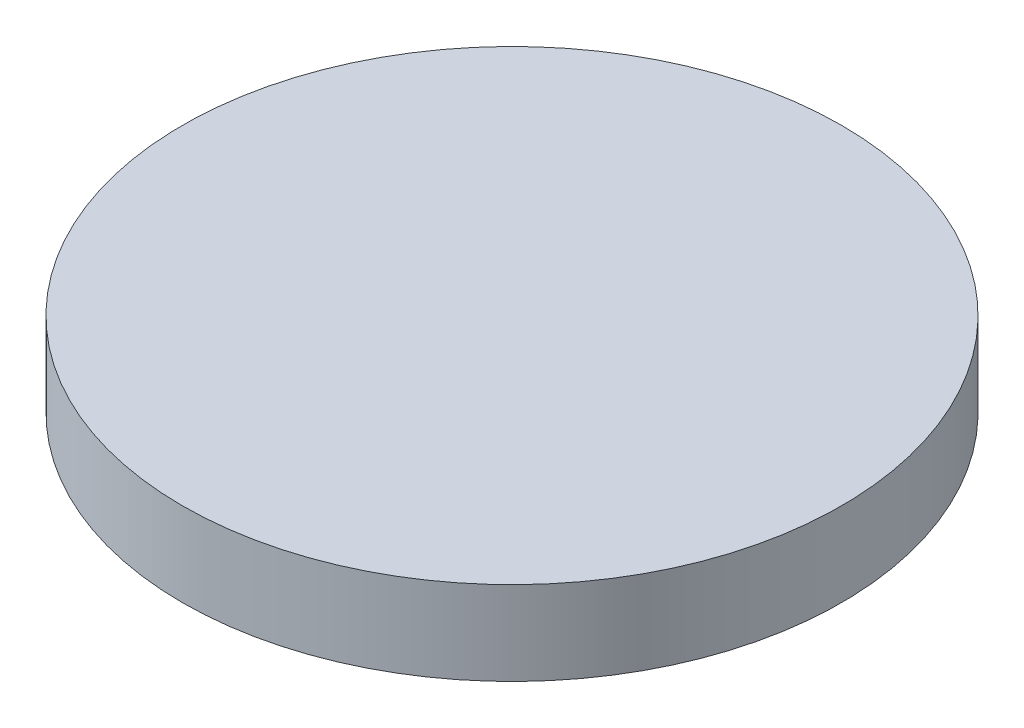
ISO-10303-21;
HEADER;
FILE_DESCRIPTION(('STEP AP214'),'2;1');
FILE_NAME('part.step','',(''),(''),'','','');
FILE_SCHEMA(('AUTOMOTIVE_DESIGN { 1 0 10303 214 1 1 1 1 }'));
ENDSEC;
DATA;
#1=APPLICATION_CONTEXT('core data for automotive mechanical design processes');
#2=APPLICATION_PROTOCOL_DEFINITION('international standard','automotive_design',2000,#1);
#3=PRODUCT_CONTEXT('',#1,'mechanical');
#4=PRODUCT('Part','Part','',(#3));
#5=PRODUCT_RELATED_PRODUCT_CATEGORY('part','',(#4));
#6=PRODUCT_DEFINITION_FORMATION('','',#4);
#7=PRODUCT_DEFINITION_CONTEXT('part definition',#1,'design');
#8=PRODUCT_DEFINITION('design','',#6,#7);
#9=PRODUCT_DEFINITION_SHAPE('','',#8);
#10=(LENGTH_UNIT() NAMED_UNIT(*) SI_UNIT(.MILLI.,.METRE.));
#11=(NAMED_UNIT(*) PLANE_ANGLE_UNIT() SI_UNIT($,.RADIAN.));
#12=(NAMED_UNIT(*) SI_UNIT($,.STERADIAN.) SOLID_ANGLE_UNIT());
#13=UNCERTAINTY_MEASURE_WITH_UNIT(LENGTH_MEASURE(1.E-05),#10,'distance_accuracy_value','');
#14=(GEOMETRIC_REPRESENTATION_CONTEXT(3) GLOBAL_UNCERTAINTY_ASSIGNED_CONTEXT((#13)) GLOBAL_UNIT_ASSIGNED_CONTEXT((#10,
#11,#12)) REPRESENTATION_CONTEXT('',''));
#15=CARTESIAN_POINT('',(0.,0.,0.));
#16=DIRECTION('',(0.,0.,1.));
#17=DIRECTION('',(1.,0.,0.));
#18=AXIS2_PLACEMENT_3D('',#15,#16,#17);
#19=CARTESIAN_POINT('',(0.,140.,0.));
#20=DIRECTION('',(0.,-1.,0.));
#21=DIRECTION('',(0.,0.,-1.));
#22=AXIS2_PLACEMENT_3D('',#19,#20,#21);
#23=CYLINDRICAL_SURFACE('',#22,550.);
#24=CARTESIAN_POINT('',(0.,140.,0.));
#25=DIRECTION('',(0.,1.,0.));
#26=DIRECTION('',(0.,0.,1.));
#27=AXIS2_PLACEMENT_3D('',#24,#25,#26);
#28=CIRCLE('',#27,550.);
#29=CARTESIAN_POINT('',(0.,140.,550.));
#30=VERTEX_POINT('',#29);
#31=EDGE_CURVE('E10',#30,#30,#28,.T.);
#32=ORIENTED_EDGE('',*,*,#31,.F.);
#33=EDGE_LOOP('',(#32));
#34=FACE_BOUND('',#33,.T.);
#35=CARTESIAN_POINT('',(0.,0.,0.));
#36=DIRECTION('',(0.,1.,0.));
#37=DIRECTION('',(0.,0.,1.));
#38=AXIS2_PLACEMENT_3D('',#35,#36,#37);
#39=CIRCLE('',#38,550.);
#40=CARTESIAN_POINT('',(0.,0.,550.));
#41=VERTEX_POINT('',#40);
#42=EDGE_CURVE('E36',#41,#41,#39,.T.);
#43=ORIENTED_EDGE('',*,*,#42,.T.);
#44=EDGE_LOOP('',(#43));
#45=FACE_BOUND('',#44,.T.);
#46=ADVANCED_FACE('F33',(#34,#45),#23,.T.);
#47=CARTESIAN_POINT('',(0.,140.,0.));
#48=DIRECTION('',(0.,1.,0.));
#49=DIRECTION('',(0.,0.,1.));
#50=AXIS2_PLACEMENT_3D('',#47,#48,#49);
#51=PLANE('',#50);
#52=ORIENTED_EDGE('',*,*,#31,.T.);
#53=EDGE_LOOP('',(#52));
#54=FACE_BOUND('',#53,.T.);
#55=ADVANCED_FACE('F48',(#54),#51,.T.);
#56=CARTESIAN_POINT('',(0.,0.,0.));
#57=DIRECTION('',(0.,1.,0.));
#58=DIRECTION('',(0.,0.,1.));
#59=AXIS2_PLACEMENT_3D('',#56,#57,#58);
#60=PLANE('',#59);
#61=ORIENTED_EDGE('',*,*,#42,.F.);
#62=EDGE_LOOP('',(#61));
#63=FACE_BOUND('',#62,.T.);
#64=ADVANCED_FACE('F46',(#63),#60,.F.);
#65=CLOSED_SHELL('',(#46,#55,#64));
#66=MANIFOLD_SOLID_BREP('B2',#65);
#67=ADVANCED_BREP_SHAPE_REPRESENTATION('',(#18,#66),#14);
#68=SHAPE_DEFINITION_REPRESENTATION(#9,#67);
ENDSEC;
END-ISO-10303-21;
